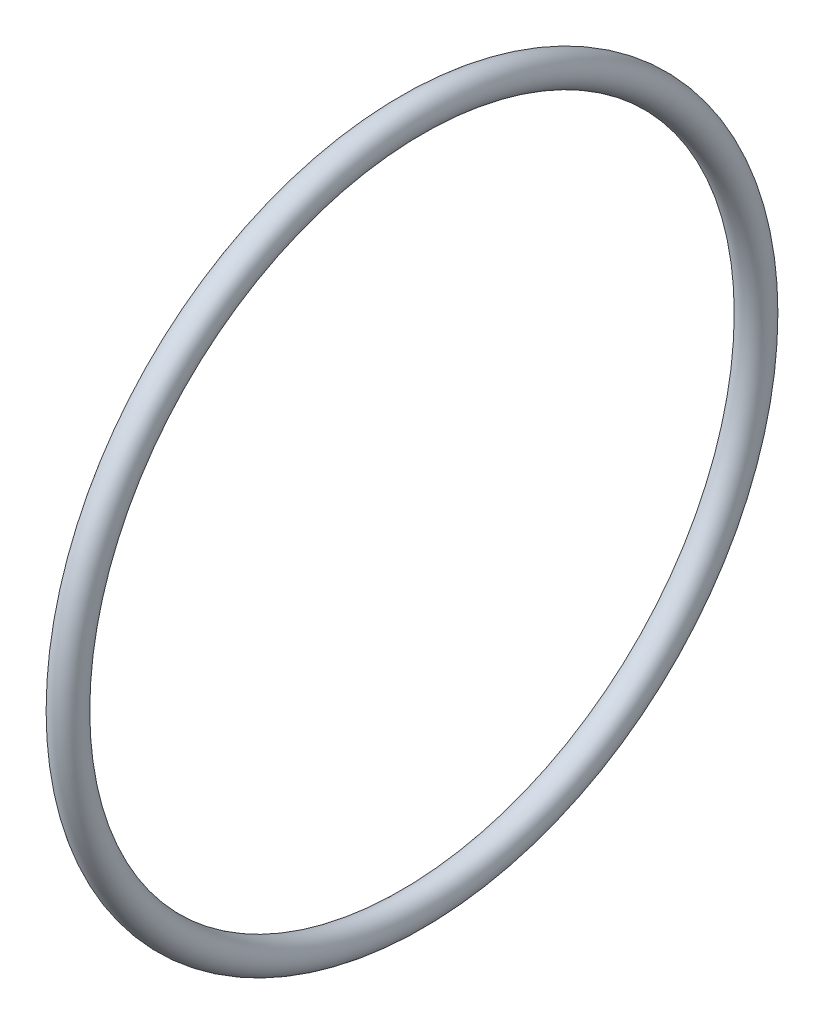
from build123d import *

# Parameters (mm, degrees)
SKETCH1_R = 0.889


with BuildPart() as part:
    # Sketch1 → Base-Revolve (revolve)
    with BuildSketch(Plane.XY, mode=Mode.PRIVATE) as base_revolve_sk:
        with Locations((0, 19.7993)):
            Circle(SKETCH1_R)
    revolve(base_revolve_sk.sketch.rotate(Axis((0, 0, 0), (1, 0, 0)), 90), axis=Axis((0, 0, 0), (1, 0, 0)))


solid = part.part
